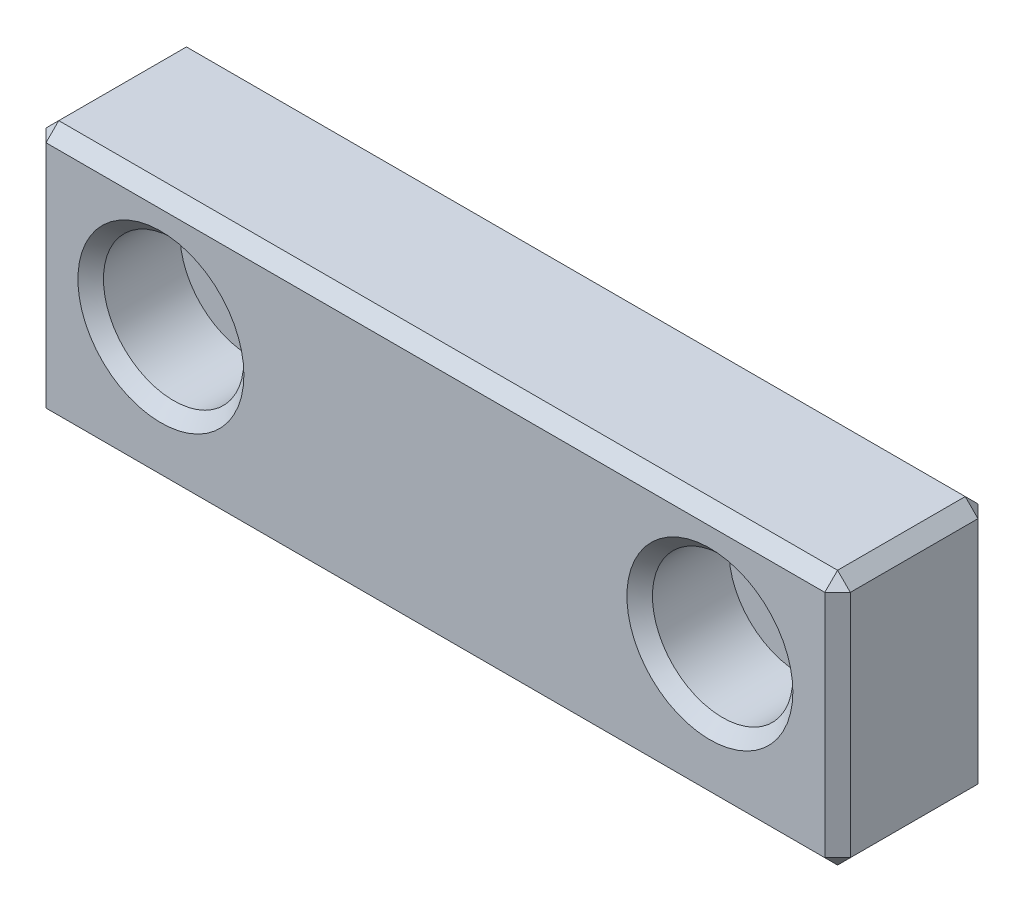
ISO-10303-21;
HEADER;
FILE_DESCRIPTION(('STEP AP214'),'2;1');
FILE_NAME('part.step','',(''),(''),'','','');
FILE_SCHEMA(('AUTOMOTIVE_DESIGN { 1 0 10303 214 1 1 1 1 }'));
ENDSEC;
DATA;
#1=APPLICATION_CONTEXT('core data for automotive mechanical design processes');
#2=APPLICATION_PROTOCOL_DEFINITION('international standard','automotive_design',2000,#1);
#3=PRODUCT_CONTEXT('',#1,'mechanical');
#4=PRODUCT('Part','Part','',(#3));
#5=PRODUCT_RELATED_PRODUCT_CATEGORY('part','',(#4));
#6=PRODUCT_DEFINITION_FORMATION('','',#4);
#7=PRODUCT_DEFINITION_CONTEXT('part definition',#1,'design');
#8=PRODUCT_DEFINITION('design','',#6,#7);
#9=PRODUCT_DEFINITION_SHAPE('','',#8);
#10=(LENGTH_UNIT() NAMED_UNIT(*) SI_UNIT(.MILLI.,.METRE.));
#11=(NAMED_UNIT(*) PLANE_ANGLE_UNIT() SI_UNIT($,.RADIAN.));
#12=(NAMED_UNIT(*) SI_UNIT($,.STERADIAN.) SOLID_ANGLE_UNIT());
#13=UNCERTAINTY_MEASURE_WITH_UNIT(LENGTH_MEASURE(1.E-05),#10,'distance_accuracy_value','');
#14=(GEOMETRIC_REPRESENTATION_CONTEXT(3) GLOBAL_UNCERTAINTY_ASSIGNED_CONTEXT((#13)) GLOBAL_UNIT_ASSIGNED_CONTEXT((#10,
#11,#12)) REPRESENTATION_CONTEXT('',''));
#15=CARTESIAN_POINT('',(0.,0.,0.));
#16=DIRECTION('',(0.,0.,1.));
#17=DIRECTION('',(1.,0.,0.));
#18=AXIS2_PLACEMENT_3D('',#15,#16,#17);
#19=CARTESIAN_POINT('',(-21.5,1.,12.));
#20=DIRECTION('',(0.,0.,-1.));
#21=DIRECTION('',(-1.,0.,0.));
#22=AXIS2_PLACEMENT_3D('',#19,#20,#21);
#23=CYLINDRICAL_SURFACE('',#22,3.);
#24=CARTESIAN_POINT('',(-21.5,1.,1.00000000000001));
#25=DIRECTION('',(0.,0.,1.));
#26=DIRECTION('',(1.,0.,0.));
#27=AXIS2_PLACEMENT_3D('',#24,#25,#26);
#28=CIRCLE('',#27,3.);
#29=CARTESIAN_POINT('',(-18.5,1.,1.00000000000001));
#30=VERTEX_POINT('',#29);
#31=EDGE_CURVE('E156',#30,#30,#28,.F.);
#32=ORIENTED_EDGE('',*,*,#31,.T.);
#33=EDGE_LOOP('',(#32));
#34=FACE_BOUND('',#33,.T.);
#35=CARTESIAN_POINT('',(-21.5,1.,5.));
#36=DIRECTION('',(0.,0.,1.));
#37=DIRECTION('',(1.,0.,0.));
#38=AXIS2_PLACEMENT_3D('',#35,#36,#37);
#39=CIRCLE('',#38,3.);
#40=CARTESIAN_POINT('',(-18.5,1.,5.));
#41=VERTEX_POINT('',#40);
#42=EDGE_CURVE('E137',#41,#41,#39,.T.);
#43=ORIENTED_EDGE('',*,*,#42,.T.);
#44=EDGE_LOOP('',(#43));
#45=FACE_BOUND('',#44,.T.);
#46=ADVANCED_FACE('F16',(#34,#45),#23,.F.);
#47=CARTESIAN_POINT('',(21.5,1.,12.));
#48=DIRECTION('',(0.,0.,-1.));
#49=DIRECTION('',(-1.,0.,0.));
#50=AXIS2_PLACEMENT_3D('',#47,#48,#49);
#51=CYLINDRICAL_SURFACE('',#50,3.);
#52=CARTESIAN_POINT('',(21.5,1.,1.00000000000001));
#53=DIRECTION('',(0.,0.,1.));
#54=DIRECTION('',(1.,0.,0.));
#55=AXIS2_PLACEMENT_3D('',#52,#53,#54);
#56=CIRCLE('',#55,3.);
#57=CARTESIAN_POINT('',(24.5,1.,1.00000000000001));
#58=VERTEX_POINT('',#57);
#59=EDGE_CURVE('E153',#58,#58,#56,.F.);
#60=ORIENTED_EDGE('',*,*,#59,.T.);
#61=EDGE_LOOP('',(#60));
#62=FACE_BOUND('',#61,.T.);
#63=CARTESIAN_POINT('',(21.5,1.,5.));
#64=DIRECTION('',(0.,0.,1.));
#65=DIRECTION('',(1.,0.,0.));
#66=AXIS2_PLACEMENT_3D('',#63,#64,#65);
#67=CIRCLE('',#66,3.);
#68=CARTESIAN_POINT('',(24.5,1.,5.));
#69=VERTEX_POINT('',#68);
#70=EDGE_CURVE('E274',#69,#69,#67,.T.);
#71=ORIENTED_EDGE('',*,*,#70,.T.);
#72=EDGE_LOOP('',(#71));
#73=FACE_BOUND('',#72,.T.);
#74=ADVANCED_FACE('F304',(#62,#73),#51,.F.);
#75=CARTESIAN_POINT('',(0.,0.,12.));
#76=DIRECTION('',(0.,0.,1.));
#77=DIRECTION('',(1.,0.,0.));
#78=AXIS2_PLACEMENT_3D('',#75,#76,#77);
#79=PLANE('',#78);
#80=DIRECTION('',(0.,1.,0.));
#81=VECTOR('',#80,1.);
#82=CARTESIAN_POINT('',(30.5,10.,12.));
#83=LINE('',#82,#81);
#84=CARTESIAN_POINT('',(30.5,-9.,12.));
#85=VERTEX_POINT('',#84);
#86=CARTESIAN_POINT('',(30.5,9.,12.));
#87=VERTEX_POINT('',#86);
#88=EDGE_CURVE('E33',#85,#87,#83,.T.);
#89=ORIENTED_EDGE('',*,*,#88,.T.);
#90=DIRECTION('',(-1.,0.,0.));
#91=VECTOR('',#90,1.);
#92=CARTESIAN_POINT('',(-31.5,9.,12.));
#93=LINE('',#92,#91);
#94=CARTESIAN_POINT('',(-30.5,9.,12.));
#95=VERTEX_POINT('',#94);
#96=EDGE_CURVE('E203',#87,#95,#93,.T.);
#97=ORIENTED_EDGE('',*,*,#96,.T.);
#98=DIRECTION('',(0.,-1.,0.));
#99=VECTOR('',#98,1.);
#100=CARTESIAN_POINT('',(-30.5,-10.,12.));
#101=LINE('',#100,#99);
#102=CARTESIAN_POINT('',(-30.5,-9.,12.));
#103=VERTEX_POINT('',#102);
#104=EDGE_CURVE('E199',#95,#103,#101,.T.);
#105=ORIENTED_EDGE('',*,*,#104,.T.);
#106=DIRECTION('',(1.,0.,0.));
#107=VECTOR('',#106,1.);
#108=CARTESIAN_POINT('',(31.5,-9.,12.));
#109=LINE('',#108,#107);
#110=EDGE_CURVE('E38',#103,#85,#109,.T.);
#111=ORIENTED_EDGE('',*,*,#110,.T.);
#112=EDGE_LOOP('',(#89,#97,#105,#111));
#113=FACE_BOUND('',#112,.T.);
#114=CARTESIAN_POINT('',(21.5,1.,12.));
#115=DIRECTION('',(0.,0.,1.));
#116=DIRECTION('',(1.,0.,0.));
#117=AXIS2_PLACEMENT_3D('',#114,#115,#116);
#118=CIRCLE('',#117,6.5);
#119=CARTESIAN_POINT('',(28.,1.,12.));
#120=VERTEX_POINT('',#119);
#121=EDGE_CURVE('E196',#120,#120,#118,.F.);
#122=ORIENTED_EDGE('',*,*,#121,.T.);
#123=EDGE_LOOP('',(#122));
#124=FACE_BOUND('',#123,.T.);
#125=CARTESIAN_POINT('',(-21.5,1.,12.));
#126=DIRECTION('',(0.,0.,1.));
#127=DIRECTION('',(1.,0.,0.));
#128=AXIS2_PLACEMENT_3D('',#125,#126,#127);
#129=CIRCLE('',#128,6.5);
#130=CARTESIAN_POINT('',(-15.,1.,12.));
#131=VERTEX_POINT('',#130);
#132=EDGE_CURVE('E193',#131,#131,#129,.F.);
#133=ORIENTED_EDGE('',*,*,#132,.T.);
#134=EDGE_LOOP('',(#133));
#135=FACE_BOUND('',#134,.T.);
#136=ADVANCED_FACE('F311',(#113,#124,#135),#79,.T.);
#137=CARTESIAN_POINT('',(0.,0.,0.));
#138=DIRECTION('',(0.,0.,1.));
#139=DIRECTION('',(1.,0.,0.));
#140=AXIS2_PLACEMENT_3D('',#137,#138,#139);
#141=PLANE('',#140);
#142=CARTESIAN_POINT('',(21.5,1.,0.));
#143=DIRECTION('',(0.,0.,1.));
#144=DIRECTION('',(1.,0.,0.));
#145=AXIS2_PLACEMENT_3D('',#142,#143,#144);
#146=CIRCLE('',#145,4.);
#147=CARTESIAN_POINT('',(25.5,1.,0.));
#148=VERTEX_POINT('',#147);
#149=EDGE_CURVE('E150',#148,#148,#146,.T.);
#150=ORIENTED_EDGE('',*,*,#149,.T.);
#151=EDGE_LOOP('',(#150));
#152=FACE_BOUND('',#151,.T.);
#153=CARTESIAN_POINT('',(-21.5,1.,0.));
#154=DIRECTION('',(0.,0.,1.));
#155=DIRECTION('',(1.,0.,0.));
#156=AXIS2_PLACEMENT_3D('',#153,#154,#155);
#157=CIRCLE('',#156,4.);
#158=CARTESIAN_POINT('',(-17.5,1.,0.));
#159=VERTEX_POINT('',#158);
#160=EDGE_CURVE('E144',#159,#159,#157,.T.);
#161=ORIENTED_EDGE('',*,*,#160,.T.);
#162=EDGE_LOOP('',(#161));
#163=FACE_BOUND('',#162,.T.);
#164=DIRECTION('',(0.,1.,0.));
#165=VECTOR('',#164,1.);
#166=CARTESIAN_POINT('',(-30.5,0.,0.));
#167=LINE('',#166,#165);
#168=CARTESIAN_POINT('',(-30.5,-9.,0.));
#169=VERTEX_POINT('',#168);
#170=CARTESIAN_POINT('',(-30.5,9.,0.));
#171=VERTEX_POINT('',#170);
#172=EDGE_CURVE('E136',#169,#171,#167,.T.);
#173=ORIENTED_EDGE('',*,*,#172,.T.);
#174=DIRECTION('',(1.,0.,0.));
#175=VECTOR('',#174,1.);
#176=CARTESIAN_POINT('',(0.,9.,0.));
#177=LINE('',#176,#175);
#178=CARTESIAN_POINT('',(30.5,9.,0.));
#179=VERTEX_POINT('',#178);
#180=EDGE_CURVE('E141',#171,#179,#177,.T.);
#181=ORIENTED_EDGE('',*,*,#180,.T.);
#182=DIRECTION('',(0.,-1.,0.));
#183=VECTOR('',#182,1.);
#184=CARTESIAN_POINT('',(30.5,0.,0.));
#185=LINE('',#184,#183);
#186=CARTESIAN_POINT('',(30.5,-9.,0.));
#187=VERTEX_POINT('',#186);
#188=EDGE_CURVE('E111',#179,#187,#185,.T.);
#189=ORIENTED_EDGE('',*,*,#188,.T.);
#190=DIRECTION('',(-1.,0.,0.));
#191=VECTOR('',#190,1.);
#192=CARTESIAN_POINT('',(0.,-9.,0.));
#193=LINE('',#192,#191);
#194=EDGE_CURVE('E130',#187,#169,#193,.T.);
#195=ORIENTED_EDGE('',*,*,#194,.T.);
#196=EDGE_LOOP('',(#173,#181,#189,#195));
#197=FACE_BOUND('',#196,.T.);
#198=ADVANCED_FACE('F139',(#152,#163,#197),#141,.F.);
#199=CARTESIAN_POINT('',(-31.5,-10.,12.));
#200=DIRECTION('',(1.,0.,0.));
#201=DIRECTION('',(0.,0.,-1.));
#202=AXIS2_PLACEMENT_3D('',#199,#200,#201);
#203=PLANE('',#202);
#204=DIRECTION('',(0.,0.,-1.));
#205=VECTOR('',#204,1.);
#206=CARTESIAN_POINT('',(-31.5,9.,12.));
#207=LINE('',#206,#205);
#208=CARTESIAN_POINT('',(-31.5,9.,11.));
#209=VERTEX_POINT('',#208);
#210=CARTESIAN_POINT('',(-31.5,9.,1.));
#211=VERTEX_POINT('',#210);
#212=EDGE_CURVE('E170',#209,#211,#207,.T.);
#213=ORIENTED_EDGE('',*,*,#212,.T.);
#214=DIRECTION('',(0.,-1.,0.));
#215=VECTOR('',#214,1.);
#216=CARTESIAN_POINT('',(-31.5,-10.,1.));
#217=LINE('',#216,#215);
#218=CARTESIAN_POINT('',(-31.5,-9.,1.));
#219=VERTEX_POINT('',#218);
#220=EDGE_CURVE('E172',#211,#219,#217,.T.);
#221=ORIENTED_EDGE('',*,*,#220,.T.);
#222=DIRECTION('',(0.,0.,1.));
#223=VECTOR('',#222,1.);
#224=CARTESIAN_POINT('',(-31.5,-9.,12.));
#225=LINE('',#224,#223);
#226=CARTESIAN_POINT('',(-31.5,-9.,11.));
#227=VERTEX_POINT('',#226);
#228=EDGE_CURVE('E168',#219,#227,#225,.T.);
#229=ORIENTED_EDGE('',*,*,#228,.T.);
#230=DIRECTION('',(0.,1.,0.));
#231=VECTOR('',#230,1.);
#232=CARTESIAN_POINT('',(-31.5,10.,11.));
#233=LINE('',#232,#231);
#234=EDGE_CURVE('E166',#227,#209,#233,.T.);
#235=ORIENTED_EDGE('',*,*,#234,.T.);
#236=EDGE_LOOP('',(#213,#221,#229,#235));
#237=FACE_BOUND('',#236,.T.);
#238=ADVANCED_FACE('F320',(#237),#203,.F.);
#239=CARTESIAN_POINT('',(31.5,-10.,12.));
#240=DIRECTION('',(0.,1.,0.));
#241=DIRECTION('',(-1.,0.,0.));
#242=AXIS2_PLACEMENT_3D('',#239,#240,#241);
#243=PLANE('',#242);
#244=DIRECTION('',(-1.,0.,0.));
#245=VECTOR('',#244,1.);
#246=CARTESIAN_POINT('',(-31.5,-10.,11.));
#247=LINE('',#246,#245);
#248=CARTESIAN_POINT('',(30.5,-10.,11.));
#249=VERTEX_POINT('',#248);
#250=CARTESIAN_POINT('',(-30.5,-10.,11.));
#251=VERTEX_POINT('',#250);
#252=EDGE_CURVE('E184',#249,#251,#247,.T.);
#253=ORIENTED_EDGE('',*,*,#252,.T.);
#254=DIRECTION('',(0.,0.,-1.));
#255=VECTOR('',#254,1.);
#256=CARTESIAN_POINT('',(-30.5,-10.,12.));
#257=LINE('',#256,#255);
#258=CARTESIAN_POINT('',(-30.5,-10.,1.));
#259=VERTEX_POINT('',#258);
#260=EDGE_CURVE('E190',#251,#259,#257,.T.);
#261=ORIENTED_EDGE('',*,*,#260,.T.);
#262=DIRECTION('',(1.,0.,0.));
#263=VECTOR('',#262,1.);
#264=CARTESIAN_POINT('',(31.5,-10.,1.));
#265=LINE('',#264,#263);
#266=CARTESIAN_POINT('',(30.5,-10.,1.));
#267=VERTEX_POINT('',#266);
#268=EDGE_CURVE('E188',#259,#267,#265,.T.);
#269=ORIENTED_EDGE('',*,*,#268,.T.);
#270=DIRECTION('',(0.,0.,1.));
#271=VECTOR('',#270,1.);
#272=CARTESIAN_POINT('',(30.5,-10.,12.));
#273=LINE('',#272,#271);
#274=EDGE_CURVE('E186',#267,#249,#273,.T.);
#275=ORIENTED_EDGE('',*,*,#274,.T.);
#276=EDGE_LOOP('',(#253,#261,#269,#275));
#277=FACE_BOUND('',#276,.T.);
#278=ADVANCED_FACE('F329',(#277),#243,.F.);
#279=CARTESIAN_POINT('',(31.5,-10.,12.));
#280=DIRECTION('',(-1.,0.,0.));
#281=DIRECTION('',(0.,0.,1.));
#282=AXIS2_PLACEMENT_3D('',#279,#280,#281);
#283=PLANE('',#282);
#284=DIRECTION('',(0.,0.,-1.));
#285=VECTOR('',#284,1.);
#286=CARTESIAN_POINT('',(31.5,-9.,12.));
#287=LINE('',#286,#285);
#288=CARTESIAN_POINT('',(31.5,-9.,11.));
#289=VERTEX_POINT('',#288);
#290=CARTESIAN_POINT('',(31.5,-9.,1.));
#291=VERTEX_POINT('',#290);
#292=EDGE_CURVE('E161',#289,#291,#287,.T.);
#293=ORIENTED_EDGE('',*,*,#292,.T.);
#294=DIRECTION('',(0.,1.,0.));
#295=VECTOR('',#294,1.);
#296=CARTESIAN_POINT('',(31.5,-10.,1.));
#297=LINE('',#296,#295);
#298=CARTESIAN_POINT('',(31.5,9.,1.));
#299=VERTEX_POINT('',#298);
#300=EDGE_CURVE('E114',#291,#299,#297,.T.);
#301=ORIENTED_EDGE('',*,*,#300,.T.);
#302=DIRECTION('',(0.,0.,1.));
#303=VECTOR('',#302,1.);
#304=CARTESIAN_POINT('',(31.5,9.,12.));
#305=LINE('',#304,#303);
#306=CARTESIAN_POINT('',(31.5,9.,11.));
#307=VERTEX_POINT('',#306);
#308=EDGE_CURVE('E163',#299,#307,#305,.T.);
#309=ORIENTED_EDGE('',*,*,#308,.T.);
#310=DIRECTION('',(0.,-1.,0.));
#311=VECTOR('',#310,1.);
#312=CARTESIAN_POINT('',(31.5,-10.,11.));
#313=LINE('',#312,#311);
#314=EDGE_CURVE('E159',#307,#289,#313,.T.);
#315=ORIENTED_EDGE('',*,*,#314,.T.);
#316=EDGE_LOOP('',(#293,#301,#309,#315));
#317=FACE_BOUND('',#316,.T.);
#318=ADVANCED_FACE('F325',(#317),#283,.F.);
#319=CARTESIAN_POINT('',(31.5,10.,12.));
#320=DIRECTION('',(0.,-1.,0.));
#321=DIRECTION('',(1.,0.,0.));
#322=AXIS2_PLACEMENT_3D('',#319,#320,#321);
#323=PLANE('',#322);
#324=DIRECTION('',(1.,0.,0.));
#325=VECTOR('',#324,1.);
#326=CARTESIAN_POINT('',(31.5,10.,11.));
#327=LINE('',#326,#325);
#328=CARTESIAN_POINT('',(-30.5,10.,11.));
#329=VERTEX_POINT('',#328);
#330=CARTESIAN_POINT('',(30.5,10.,11.));
#331=VERTEX_POINT('',#330);
#332=EDGE_CURVE('E175',#329,#331,#327,.T.);
#333=ORIENTED_EDGE('',*,*,#332,.T.);
#334=DIRECTION('',(0.,0.,-1.));
#335=VECTOR('',#334,1.);
#336=CARTESIAN_POINT('',(30.5,10.,12.));
#337=LINE('',#336,#335);
#338=CARTESIAN_POINT('',(30.5,10.,1.));
#339=VERTEX_POINT('',#338);
#340=EDGE_CURVE('E181',#331,#339,#337,.T.);
#341=ORIENTED_EDGE('',*,*,#340,.T.);
#342=DIRECTION('',(-1.,0.,0.));
#343=VECTOR('',#342,1.);
#344=CARTESIAN_POINT('',(31.5,10.,1.));
#345=LINE('',#344,#343);
#346=CARTESIAN_POINT('',(-30.5,10.,1.));
#347=VERTEX_POINT('',#346);
#348=EDGE_CURVE('E179',#339,#347,#345,.T.);
#349=ORIENTED_EDGE('',*,*,#348,.T.);
#350=DIRECTION('',(0.,0.,1.));
#351=VECTOR('',#350,1.);
#352=CARTESIAN_POINT('',(-30.5,10.,12.));
#353=LINE('',#352,#351);
#354=EDGE_CURVE('E177',#347,#329,#353,.T.);
#355=ORIENTED_EDGE('',*,*,#354,.T.);
#356=EDGE_LOOP('',(#333,#341,#349,#355));
#357=FACE_BOUND('',#356,.T.);
#358=ADVANCED_FACE('F322',(#357),#323,.F.);
#359=CARTESIAN_POINT('',(21.5,1.,5.));
#360=DIRECTION('',(0.,0.,1.));
#361=DIRECTION('',(1.,0.,0.));
#362=AXIS2_PLACEMENT_3D('',#359,#360,#361);
#363=CYLINDRICAL_SURFACE('',#362,5.5);
#364=CARTESIAN_POINT('',(21.5,1.,11.));
#365=DIRECTION('',(0.,0.,1.));
#366=DIRECTION('',(1.,0.,0.));
#367=AXIS2_PLACEMENT_3D('',#364,#365,#366);
#368=CIRCLE('',#367,5.5);
#369=CARTESIAN_POINT('',(27.,1.,11.));
#370=VERTEX_POINT('',#369);
#371=EDGE_CURVE('E25',#370,#370,#368,.T.);
#372=ORIENTED_EDGE('',*,*,#371,.T.);
#373=EDGE_LOOP('',(#372));
#374=FACE_BOUND('',#373,.T.);
#375=CARTESIAN_POINT('',(21.5,1.,5.));
#376=DIRECTION('',(0.,0.,1.));
#377=DIRECTION('',(1.,0.,0.));
#378=AXIS2_PLACEMENT_3D('',#375,#376,#377);
#379=CIRCLE('',#378,5.5);
#380=CARTESIAN_POINT('',(27.,1.,5.));
#381=VERTEX_POINT('',#380);
#382=EDGE_CURVE('E263',#381,#381,#379,.T.);
#383=ORIENTED_EDGE('',*,*,#382,.F.);
#384=EDGE_LOOP('',(#383));
#385=FACE_BOUND('',#384,.T.);
#386=ADVANCED_FACE('F300',(#374,#385),#363,.F.);
#387=CARTESIAN_POINT('',(21.5,1.,5.));
#388=DIRECTION('',(0.,0.,1.));
#389=DIRECTION('',(1.,0.,0.));
#390=AXIS2_PLACEMENT_3D('',#387,#388,#389);
#391=PLANE('',#390);
#392=ORIENTED_EDGE('',*,*,#70,.F.);
#393=EDGE_LOOP('',(#392));
#394=FACE_BOUND('',#393,.T.);
#395=ORIENTED_EDGE('',*,*,#382,.T.);
#396=EDGE_LOOP('',(#395));
#397=FACE_BOUND('',#396,.T.);
#398=ADVANCED_FACE('F292',(#394,#397),#391,.T.);
#399=CARTESIAN_POINT('',(-21.5,1.,5.));
#400=DIRECTION('',(0.,0.,1.));
#401=DIRECTION('',(1.,0.,0.));
#402=AXIS2_PLACEMENT_3D('',#399,#400,#401);
#403=CYLINDRICAL_SURFACE('',#402,5.5);
#404=CARTESIAN_POINT('',(-21.5,1.,11.));
#405=DIRECTION('',(0.,0.,1.));
#406=DIRECTION('',(1.,0.,0.));
#407=AXIS2_PLACEMENT_3D('',#404,#405,#406);
#408=CIRCLE('',#407,5.5);
#409=CARTESIAN_POINT('',(-16.,1.,11.));
#410=VERTEX_POINT('',#409);
#411=EDGE_CURVE('E10',#410,#410,#408,.T.);
#412=ORIENTED_EDGE('',*,*,#411,.T.);
#413=EDGE_LOOP('',(#412));
#414=FACE_BOUND('',#413,.T.);
#415=CARTESIAN_POINT('',(-21.5,1.,5.));
#416=DIRECTION('',(0.,0.,1.));
#417=DIRECTION('',(1.,0.,0.));
#418=AXIS2_PLACEMENT_3D('',#415,#416,#417);
#419=CIRCLE('',#418,5.5);
#420=CARTESIAN_POINT('',(-16.,1.,5.));
#421=VERTEX_POINT('',#420);
#422=EDGE_CURVE('E269',#421,#421,#419,.T.);
#423=ORIENTED_EDGE('',*,*,#422,.F.);
#424=EDGE_LOOP('',(#423));
#425=FACE_BOUND('',#424,.T.);
#426=ADVANCED_FACE('F287',(#414,#425),#403,.F.);
#427=CARTESIAN_POINT('',(-21.5,1.,5.));
#428=DIRECTION('',(0.,0.,1.));
#429=DIRECTION('',(1.,0.,0.));
#430=AXIS2_PLACEMENT_3D('',#427,#428,#429);
#431=PLANE('',#430);
#432=ORIENTED_EDGE('',*,*,#42,.F.);
#433=EDGE_LOOP('',(#432));
#434=FACE_BOUND('',#433,.T.);
#435=ORIENTED_EDGE('',*,*,#422,.T.);
#436=EDGE_LOOP('',(#435));
#437=FACE_BOUND('',#436,.T.);
#438=ADVANCED_FACE('F283',(#434,#437),#431,.T.);
#439=CARTESIAN_POINT('',(21.5,1.,0.));
#440=DIRECTION('',(0.,0.,-1.));
#441=DIRECTION('',(-1.,0.,0.));
#442=AXIS2_PLACEMENT_3D('',#439,#440,#441);
#443=CONICAL_SURFACE('',#442,4.,0.785398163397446);
#444=ORIENTED_EDGE('',*,*,#59,.F.);
#445=EDGE_LOOP('',(#444));
#446=FACE_BOUND('',#445,.T.);
#447=ORIENTED_EDGE('',*,*,#149,.F.);
#448=EDGE_LOOP('',(#447));
#449=FACE_BOUND('',#448,.T.);
#450=ADVANCED_FACE('F286',(#446,#449),#443,.F.);
#451=CARTESIAN_POINT('',(-21.5,1.,0.));
#452=DIRECTION('',(0.,0.,-1.));
#453=DIRECTION('',(-1.,0.,0.));
#454=AXIS2_PLACEMENT_3D('',#451,#452,#453);
#455=CONICAL_SURFACE('',#454,4.,0.785398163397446);
#456=ORIENTED_EDGE('',*,*,#31,.F.);
#457=EDGE_LOOP('',(#456));
#458=FACE_BOUND('',#457,.T.);
#459=ORIENTED_EDGE('',*,*,#160,.F.);
#460=EDGE_LOOP('',(#459));
#461=FACE_BOUND('',#460,.T.);
#462=ADVANCED_FACE('F339',(#458,#461),#455,.F.);
#463=CARTESIAN_POINT('',(-30.5,0.,12.));
#464=DIRECTION('',(-0.70710678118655,0.,0.707106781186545));
#465=DIRECTION('',(0.,1.,0.));
#466=AXIS2_PLACEMENT_3D('',#463,#464,#465);
#467=PLANE('',#466);
#468=DIRECTION('',(-0.707106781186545,0.,-0.70710678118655));
#469=VECTOR('',#468,1.);
#470=CARTESIAN_POINT('',(-31.5,-9.,11.));
#471=LINE('',#470,#469);
#472=EDGE_CURVE('E20',#103,#227,#471,.T.);
#473=ORIENTED_EDGE('',*,*,#472,.F.);
#474=ORIENTED_EDGE('',*,*,#104,.F.);
#475=DIRECTION('',(0.707106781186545,0.,0.70710678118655));
#476=VECTOR('',#475,1.);
#477=CARTESIAN_POINT('',(-31.,9.,11.5));
#478=LINE('',#477,#476);
#479=EDGE_CURVE('E255',#209,#95,#478,.T.);
#480=ORIENTED_EDGE('',*,*,#479,.F.);
#481=ORIENTED_EDGE('',*,*,#234,.F.);
#482=EDGE_LOOP('',(#473,#474,#480,#481));
#483=FACE_BOUND('',#482,.T.);
#484=ADVANCED_FACE('F343',(#483),#467,.T.);
#485=CARTESIAN_POINT('',(-31.5,-9.,11.));
#486=DIRECTION('',(-0.57735026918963,-0.577350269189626,0.577350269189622));
#487=DIRECTION('',(0.707106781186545,-0.70710678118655,0.));
#488=AXIS2_PLACEMENT_3D('',#485,#486,#487);
#489=PLANE('',#488);
#490=DIRECTION('',(0.,0.707106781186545,0.70710678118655));
#491=VECTOR('',#490,1.);
#492=CARTESIAN_POINT('',(-30.5,-9.5,11.5));
#493=LINE('',#492,#491);
#494=EDGE_CURVE('E250',#103,#251,#493,.F.);
#495=ORIENTED_EDGE('',*,*,#494,.F.);
#496=ORIENTED_EDGE('',*,*,#472,.T.);
#497=DIRECTION('',(-0.707106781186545,0.70710678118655,0.));
#498=VECTOR('',#497,1.);
#499=CARTESIAN_POINT('',(-31.5,-9.,11.));
#500=LINE('',#499,#498);
#501=EDGE_CURVE('E253',#251,#227,#500,.T.);
#502=ORIENTED_EDGE('',*,*,#501,.F.);
#503=EDGE_LOOP('',(#495,#496,#502));
#504=FACE_BOUND('',#503,.T.);
#505=ADVANCED_FACE('F411',(#504),#489,.T.);
#506=CARTESIAN_POINT('',(-30.5,10.,11.));
#507=DIRECTION('',(-0.57735026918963,0.577350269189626,0.577350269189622));
#508=DIRECTION('',(-0.707106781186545,-0.70710678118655,0.));
#509=AXIS2_PLACEMENT_3D('',#506,#507,#508);
#510=PLANE('',#509);
#511=DIRECTION('',(0.707106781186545,0.70710678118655,0.));
#512=VECTOR('',#511,1.);
#513=CARTESIAN_POINT('',(-30.5,10.,11.));
#514=LINE('',#513,#512);
#515=EDGE_CURVE('E245',#209,#329,#514,.T.);
#516=ORIENTED_EDGE('',*,*,#515,.F.);
#517=ORIENTED_EDGE('',*,*,#479,.T.);
#518=DIRECTION('',(0.,0.707106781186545,-0.70710678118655));
#519=VECTOR('',#518,1.);
#520=CARTESIAN_POINT('',(-30.5,10.,11.));
#521=LINE('',#520,#519);
#522=EDGE_CURVE('E248',#329,#95,#521,.F.);
#523=ORIENTED_EDGE('',*,*,#522,.F.);
#524=EDGE_LOOP('',(#516,#517,#523));
#525=FACE_BOUND('',#524,.T.);
#526=ADVANCED_FACE('F407',(#525),#510,.T.);
#527=CARTESIAN_POINT('',(-30.5,-10.,12.));
#528=DIRECTION('',(0.70710678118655,0.707106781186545,0.));
#529=DIRECTION('',(0.,0.,-1.));
#530=AXIS2_PLACEMENT_3D('',#527,#528,#529);
#531=PLANE('',#530);
#532=ORIENTED_EDGE('',*,*,#501,.T.);
#533=ORIENTED_EDGE('',*,*,#228,.F.);
#534=DIRECTION('',(0.707106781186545,-0.70710678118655,0.));
#535=VECTOR('',#534,1.);
#536=CARTESIAN_POINT('',(-31.5,-9.,1.));
#537=LINE('',#536,#535);
#538=EDGE_CURVE('E240',#259,#219,#537,.F.);
#539=ORIENTED_EDGE('',*,*,#538,.F.);
#540=ORIENTED_EDGE('',*,*,#260,.F.);
#541=EDGE_LOOP('',(#532,#533,#539,#540));
#542=FACE_BOUND('',#541,.T.);
#543=ADVANCED_FACE('F403',(#542),#531,.F.);
#544=CARTESIAN_POINT('',(0.,-9.,12.));
#545=DIRECTION('',(0.,-0.70710678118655,0.707106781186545));
#546=DIRECTION('',(-1.,0.,0.));
#547=AXIS2_PLACEMENT_3D('',#544,#545,#546);
#548=PLANE('',#547);
#549=ORIENTED_EDGE('',*,*,#494,.T.);
#550=ORIENTED_EDGE('',*,*,#252,.F.);
#551=DIRECTION('',(0.,-0.707106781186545,-0.70710678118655));
#552=VECTOR('',#551,1.);
#553=CARTESIAN_POINT('',(30.5,-10.,11.));
#554=LINE('',#553,#552);
#555=EDGE_CURVE('E237',#85,#249,#554,.T.);
#556=ORIENTED_EDGE('',*,*,#555,.F.);
#557=ORIENTED_EDGE('',*,*,#110,.F.);
#558=EDGE_LOOP('',(#549,#550,#556,#557));
#559=FACE_BOUND('',#558,.T.);
#560=ADVANCED_FACE('F399',(#559),#548,.T.);
#561=CARTESIAN_POINT('',(30.5,0.,12.));
#562=DIRECTION('',(0.70710678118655,0.,0.707106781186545));
#563=DIRECTION('',(0.,-1.,0.));
#564=AXIS2_PLACEMENT_3D('',#561,#562,#563);
#565=PLANE('',#564);
#566=DIRECTION('',(0.707106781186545,0.,-0.70710678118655));
#567=VECTOR('',#566,1.);
#568=CARTESIAN_POINT('',(31.5,9.,11.));
#569=LINE('',#568,#567);
#570=EDGE_CURVE('E231',#87,#307,#569,.T.);
#571=ORIENTED_EDGE('',*,*,#570,.F.);
#572=ORIENTED_EDGE('',*,*,#88,.F.);
#573=DIRECTION('',(-0.707106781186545,0.,0.70710678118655));
#574=VECTOR('',#573,1.);
#575=CARTESIAN_POINT('',(31.,-9.,11.5));
#576=LINE('',#575,#574);
#577=EDGE_CURVE('E234',#289,#85,#576,.T.);
#578=ORIENTED_EDGE('',*,*,#577,.F.);
#579=ORIENTED_EDGE('',*,*,#314,.F.);
#580=EDGE_LOOP('',(#571,#572,#578,#579));
#581=FACE_BOUND('',#580,.T.);
#582=ADVANCED_FACE('F395',(#581),#565,.T.);
#583=CARTESIAN_POINT('',(0.,9.,12.));
#584=DIRECTION('',(0.,0.70710678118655,0.707106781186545));
#585=DIRECTION('',(1.,0.,0.));
#586=AXIS2_PLACEMENT_3D('',#583,#584,#585);
#587=PLANE('',#586);
#588=ORIENTED_EDGE('',*,*,#522,.T.);
#589=ORIENTED_EDGE('',*,*,#96,.F.);
#590=DIRECTION('',(0.,-0.707106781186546,0.70710678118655));
#591=VECTOR('',#590,1.);
#592=CARTESIAN_POINT('',(30.5,9.5,11.5));
#593=LINE('',#592,#591);
#594=EDGE_CURVE('E228',#331,#87,#593,.T.);
#595=ORIENTED_EDGE('',*,*,#594,.F.);
#596=ORIENTED_EDGE('',*,*,#332,.F.);
#597=EDGE_LOOP('',(#588,#589,#595,#596));
#598=FACE_BOUND('',#597,.T.);
#599=ADVANCED_FACE('F391',(#598),#587,.T.);
#600=CARTESIAN_POINT('',(-31.5,9.,12.));
#601=DIRECTION('',(0.70710678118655,-0.707106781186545,0.));
#602=DIRECTION('',(0.,0.,-1.));
#603=AXIS2_PLACEMENT_3D('',#600,#601,#602);
#604=PLANE('',#603);
#605=ORIENTED_EDGE('',*,*,#515,.T.);
#606=ORIENTED_EDGE('',*,*,#354,.F.);
#607=DIRECTION('',(-0.707106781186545,-0.70710678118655,0.));
#608=VECTOR('',#607,1.);
#609=CARTESIAN_POINT('',(-31.,9.5,1.));
#610=LINE('',#609,#608);
#611=EDGE_CURVE('E225',#211,#347,#610,.F.);
#612=ORIENTED_EDGE('',*,*,#611,.F.);
#613=ORIENTED_EDGE('',*,*,#212,.F.);
#614=EDGE_LOOP('',(#605,#606,#612,#613));
#615=FACE_BOUND('',#614,.T.);
#616=ADVANCED_FACE('F387',(#615),#604,.F.);
#617=CARTESIAN_POINT('',(-31.5,-10.,1.));
#618=DIRECTION('',(0.70710678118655,0.,0.707106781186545));
#619=DIRECTION('',(0.,-1.,0.));
#620=AXIS2_PLACEMENT_3D('',#617,#618,#619);
#621=PLANE('',#620);
#622=DIRECTION('',(-0.707106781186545,0.,0.70710678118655));
#623=VECTOR('',#622,1.);
#624=CARTESIAN_POINT('',(-31.5,-9.,1.));
#625=LINE('',#624,#623);
#626=EDGE_CURVE('E242',#219,#169,#625,.F.);
#627=ORIENTED_EDGE('',*,*,#626,.F.);
#628=ORIENTED_EDGE('',*,*,#220,.F.);
#629=DIRECTION('',(0.707106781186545,0.,-0.70710678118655));
#630=VECTOR('',#629,1.);
#631=CARTESIAN_POINT('',(-30.5,9.,0.));
#632=LINE('',#631,#630);
#633=EDGE_CURVE('E222',#171,#211,#632,.F.);
#634=ORIENTED_EDGE('',*,*,#633,.F.);
#635=ORIENTED_EDGE('',*,*,#172,.F.);
#636=EDGE_LOOP('',(#627,#628,#634,#635));
#637=FACE_BOUND('',#636,.T.);
#638=ADVANCED_FACE('F383',(#637),#621,.F.);
#639=CARTESIAN_POINT('',(-31.5,-9.,1.));
#640=DIRECTION('',(-0.57735026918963,-0.577350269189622,-0.577350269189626));
#641=DIRECTION('',(-0.707106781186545,0.,0.70710678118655));
#642=AXIS2_PLACEMENT_3D('',#639,#640,#641);
#643=PLANE('',#642);
#644=ORIENTED_EDGE('',*,*,#538,.T.);
#645=ORIENTED_EDGE('',*,*,#626,.T.);
#646=DIRECTION('',(0.,0.70710678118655,-0.707106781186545));
#647=VECTOR('',#646,1.);
#648=CARTESIAN_POINT('',(-30.5,-9.5,0.5));
#649=LINE('',#648,#647);
#650=EDGE_CURVE('E133',#259,#169,#649,.T.);
#651=ORIENTED_EDGE('',*,*,#650,.F.);
#652=EDGE_LOOP('',(#644,#645,#651));
#653=FACE_BOUND('',#652,.T.);
#654=ADVANCED_FACE('F379',(#653),#643,.T.);
#655=CARTESIAN_POINT('',(30.5,-10.,11.));
#656=DIRECTION('',(0.577350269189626,-0.57735026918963,0.577350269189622));
#657=DIRECTION('',(0.70710678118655,0.707106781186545,0.));
#658=AXIS2_PLACEMENT_3D('',#655,#656,#657);
#659=PLANE('',#658);
#660=ORIENTED_EDGE('',*,*,#577,.T.);
#661=ORIENTED_EDGE('',*,*,#555,.T.);
#662=DIRECTION('',(-0.70710678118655,-0.707106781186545,0.));
#663=VECTOR('',#662,1.);
#664=CARTESIAN_POINT('',(30.5,-10.,11.));
#665=LINE('',#664,#663);
#666=EDGE_CURVE('E218',#289,#249,#665,.T.);
#667=ORIENTED_EDGE('',*,*,#666,.F.);
#668=EDGE_LOOP('',(#660,#661,#667));
#669=FACE_BOUND('',#668,.T.);
#670=ADVANCED_FACE('F375',(#669),#659,.T.);
#671=CARTESIAN_POINT('',(31.5,9.,11.));
#672=DIRECTION('',(0.57735026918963,0.577350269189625,0.577350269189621));
#673=DIRECTION('',(-0.707106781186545,0.707106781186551,0.));
#674=AXIS2_PLACEMENT_3D('',#671,#672,#673);
#675=PLANE('',#674);
#676=ORIENTED_EDGE('',*,*,#594,.T.);
#677=ORIENTED_EDGE('',*,*,#570,.T.);
#678=DIRECTION('',(0.707106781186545,-0.707106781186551,0.));
#679=VECTOR('',#678,1.);
#680=CARTESIAN_POINT('',(31.5,9.,11.));
#681=LINE('',#680,#679);
#682=EDGE_CURVE('E215',#331,#307,#681,.T.);
#683=ORIENTED_EDGE('',*,*,#682,.F.);
#684=EDGE_LOOP('',(#676,#677,#683));
#685=FACE_BOUND('',#684,.T.);
#686=ADVANCED_FACE('F371',(#685),#675,.T.);
#687=CARTESIAN_POINT('',(-30.5,9.,0.));
#688=DIRECTION('',(-0.57735026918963,0.577350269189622,-0.577350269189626));
#689=DIRECTION('',(-0.707106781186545,0.,0.70710678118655));
#690=AXIS2_PLACEMENT_3D('',#687,#688,#689);
#691=PLANE('',#690);
#692=ORIENTED_EDGE('',*,*,#633,.T.);
#693=ORIENTED_EDGE('',*,*,#611,.T.);
#694=DIRECTION('',(0.,0.70710678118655,0.707106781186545));
#695=VECTOR('',#694,1.);
#696=CARTESIAN_POINT('',(-30.5,9.,0.));
#697=LINE('',#696,#695);
#698=EDGE_CURVE('E127',#171,#347,#697,.T.);
#699=ORIENTED_EDGE('',*,*,#698,.F.);
#700=EDGE_LOOP('',(#692,#693,#699));
#701=FACE_BOUND('',#700,.T.);
#702=ADVANCED_FACE('F368',(#701),#691,.T.);
#703=CARTESIAN_POINT('',(31.5,-10.,1.));
#704=DIRECTION('',(0.,0.707106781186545,0.70710678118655));
#705=DIRECTION('',(1.,0.,0.));
#706=AXIS2_PLACEMENT_3D('',#703,#704,#705);
#707=PLANE('',#706);
#708=ORIENTED_EDGE('',*,*,#650,.T.);
#709=ORIENTED_EDGE('',*,*,#194,.F.);
#710=DIRECTION('',(0.,-0.70710678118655,0.707106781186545));
#711=VECTOR('',#710,1.);
#712=CARTESIAN_POINT('',(30.5,-9.,0.));
#713=LINE('',#712,#711);
#714=EDGE_CURVE('E121',#267,#187,#713,.F.);
#715=ORIENTED_EDGE('',*,*,#714,.F.);
#716=ORIENTED_EDGE('',*,*,#268,.F.);
#717=EDGE_LOOP('',(#708,#709,#715,#716));
#718=FACE_BOUND('',#717,.T.);
#719=ADVANCED_FACE('F131',(#718),#707,.F.);
#720=CARTESIAN_POINT('',(31.5,-9.,12.));
#721=DIRECTION('',(-0.707106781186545,0.70710678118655,0.));
#722=DIRECTION('',(0.,0.,-1.));
#723=AXIS2_PLACEMENT_3D('',#720,#721,#722);
#724=PLANE('',#723);
#725=ORIENTED_EDGE('',*,*,#666,.T.);
#726=ORIENTED_EDGE('',*,*,#274,.F.);
#727=DIRECTION('',(0.70710678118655,0.707106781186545,0.));
#728=VECTOR('',#727,1.);
#729=CARTESIAN_POINT('',(31.,-9.5,1.));
#730=LINE('',#729,#728);
#731=EDGE_CURVE('E125',#291,#267,#730,.F.);
#732=ORIENTED_EDGE('',*,*,#731,.F.);
#733=ORIENTED_EDGE('',*,*,#292,.F.);
#734=EDGE_LOOP('',(#725,#726,#732,#733));
#735=FACE_BOUND('',#734,.T.);
#736=ADVANCED_FACE('F361',(#735),#724,.F.);
#737=CARTESIAN_POINT('',(30.5,10.,12.));
#738=DIRECTION('',(-0.707106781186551,-0.707106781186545,0.));
#739=DIRECTION('',(0.,0.,-1.));
#740=AXIS2_PLACEMENT_3D('',#737,#738,#739);
#741=PLANE('',#740);
#742=ORIENTED_EDGE('',*,*,#682,.T.);
#743=ORIENTED_EDGE('',*,*,#308,.F.);
#744=DIRECTION('',(-0.707106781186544,0.707106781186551,0.));
#745=VECTOR('',#744,1.);
#746=CARTESIAN_POINT('',(31.5,9.,1.));
#747=LINE('',#746,#745);
#748=EDGE_CURVE('E209',#339,#299,#747,.F.);
#749=ORIENTED_EDGE('',*,*,#748,.F.);
#750=ORIENTED_EDGE('',*,*,#340,.F.);
#751=EDGE_LOOP('',(#742,#743,#749,#750));
#752=FACE_BOUND('',#751,.T.);
#753=ADVANCED_FACE('F357',(#752),#741,.F.);
#754=CARTESIAN_POINT('',(31.5,10.,1.));
#755=DIRECTION('',(0.,-0.707106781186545,0.70710678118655));
#756=DIRECTION('',(-1.,0.,0.));
#757=AXIS2_PLACEMENT_3D('',#754,#755,#756);
#758=PLANE('',#757);
#759=ORIENTED_EDGE('',*,*,#698,.T.);
#760=ORIENTED_EDGE('',*,*,#348,.F.);
#761=DIRECTION('',(0.,-0.70710678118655,-0.707106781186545));
#762=VECTOR('',#761,1.);
#763=CARTESIAN_POINT('',(30.5,9.5,0.5));
#764=LINE('',#763,#762);
#765=EDGE_CURVE('E117',#179,#339,#764,.F.);
#766=ORIENTED_EDGE('',*,*,#765,.F.);
#767=ORIENTED_EDGE('',*,*,#180,.F.);
#768=EDGE_LOOP('',(#759,#760,#766,#767));
#769=FACE_BOUND('',#768,.T.);
#770=ADVANCED_FACE('F354',(#769),#758,.F.);
#771=CARTESIAN_POINT('',(30.5,-9.,0.));
#772=DIRECTION('',(0.577350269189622,-0.577350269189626,-0.57735026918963));
#773=DIRECTION('',(0.,0.70710678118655,-0.707106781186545));
#774=AXIS2_PLACEMENT_3D('',#771,#772,#773);
#775=PLANE('',#774);
#776=ORIENTED_EDGE('',*,*,#731,.T.);
#777=ORIENTED_EDGE('',*,*,#714,.T.);
#778=DIRECTION('',(-0.70710678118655,0.,-0.707106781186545));
#779=VECTOR('',#778,1.);
#780=CARTESIAN_POINT('',(30.5,-9.,0.));
#781=LINE('',#780,#779);
#782=EDGE_CURVE('E107',#291,#187,#781,.T.);
#783=ORIENTED_EDGE('',*,*,#782,.F.);
#784=EDGE_LOOP('',(#776,#777,#783));
#785=FACE_BOUND('',#784,.T.);
#786=ADVANCED_FACE('F123',(#785),#775,.T.);
#787=CARTESIAN_POINT('',(31.5,9.,1.));
#788=DIRECTION('',(0.577350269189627,0.577350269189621,-0.577350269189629));
#789=DIRECTION('',(-0.707106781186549,0.,-0.707106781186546));
#790=AXIS2_PLACEMENT_3D('',#787,#788,#789);
#791=PLANE('',#790);
#792=ORIENTED_EDGE('',*,*,#765,.T.);
#793=ORIENTED_EDGE('',*,*,#748,.T.);
#794=DIRECTION('',(0.70710678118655,0.,0.707106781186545));
#795=VECTOR('',#794,1.);
#796=CARTESIAN_POINT('',(31.5,9.,1.));
#797=LINE('',#796,#795);
#798=EDGE_CURVE('E118',#179,#299,#797,.T.);
#799=ORIENTED_EDGE('',*,*,#798,.F.);
#800=EDGE_LOOP('',(#792,#793,#799));
#801=FACE_BOUND('',#800,.T.);
#802=ADVANCED_FACE('F348',(#801),#791,.T.);
#803=CARTESIAN_POINT('',(31.5,-10.,1.));
#804=DIRECTION('',(-0.707106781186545,0.,0.70710678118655));
#805=DIRECTION('',(0.,1.,0.));
#806=AXIS2_PLACEMENT_3D('',#803,#804,#805);
#807=PLANE('',#806);
#808=ORIENTED_EDGE('',*,*,#782,.T.);
#809=ORIENTED_EDGE('',*,*,#188,.F.);
#810=ORIENTED_EDGE('',*,*,#798,.T.);
#811=ORIENTED_EDGE('',*,*,#300,.F.);
#812=EDGE_LOOP('',(#808,#809,#810,#811));
#813=FACE_BOUND('',#812,.T.);
#814=ADVANCED_FACE('F109',(#813),#807,.F.);
#815=CARTESIAN_POINT('',(21.5,1.,11.));
#816=DIRECTION('',(0.,0.,1.));
#817=DIRECTION('',(1.,0.,0.));
#818=AXIS2_PLACEMENT_3D('',#815,#816,#817);
#819=CONICAL_SURFACE('',#818,5.5,0.785398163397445);
#820=ORIENTED_EDGE('',*,*,#121,.F.);
#821=EDGE_LOOP('',(#820));
#822=FACE_BOUND('',#821,.T.);
#823=ORIENTED_EDGE('',*,*,#371,.F.);
#824=EDGE_LOOP('',(#823));
#825=FACE_BOUND('',#824,.T.);
#826=ADVANCED_FACE('F347',(#822,#825),#819,.F.);
#827=CARTESIAN_POINT('',(-21.5,1.,11.));
#828=DIRECTION('',(0.,0.,1.));
#829=DIRECTION('',(1.,0.,0.));
#830=AXIS2_PLACEMENT_3D('',#827,#828,#829);
#831=CONICAL_SURFACE('',#830,5.5,0.785398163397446);
#832=ORIENTED_EDGE('',*,*,#132,.F.);
#833=EDGE_LOOP('',(#832));
#834=FACE_BOUND('',#833,.T.);
#835=ORIENTED_EDGE('',*,*,#411,.F.);
#836=EDGE_LOOP('',(#835));
#837=FACE_BOUND('',#836,.T.);
#838=ADVANCED_FACE('F18',(#834,#837),#831,.F.);
#839=CLOSED_SHELL('',(#46,#74,#136,#198,#238,#278,#318,#358,#386,#398,#426,#438,#450,#462,#484,
#505,#526,#543,#560,#582,#599,#616,#638,#654,#670,#686,#702,#719,#736,#753,#770,#786,#802,#814,
#826,#838));
#840=MANIFOLD_SOLID_BREP('B1',#839);
#841=ADVANCED_BREP_SHAPE_REPRESENTATION('',(#18,#840),#14);
#842=SHAPE_DEFINITION_REPRESENTATION(#9,#841);
ENDSEC;
END-ISO-10303-21;
